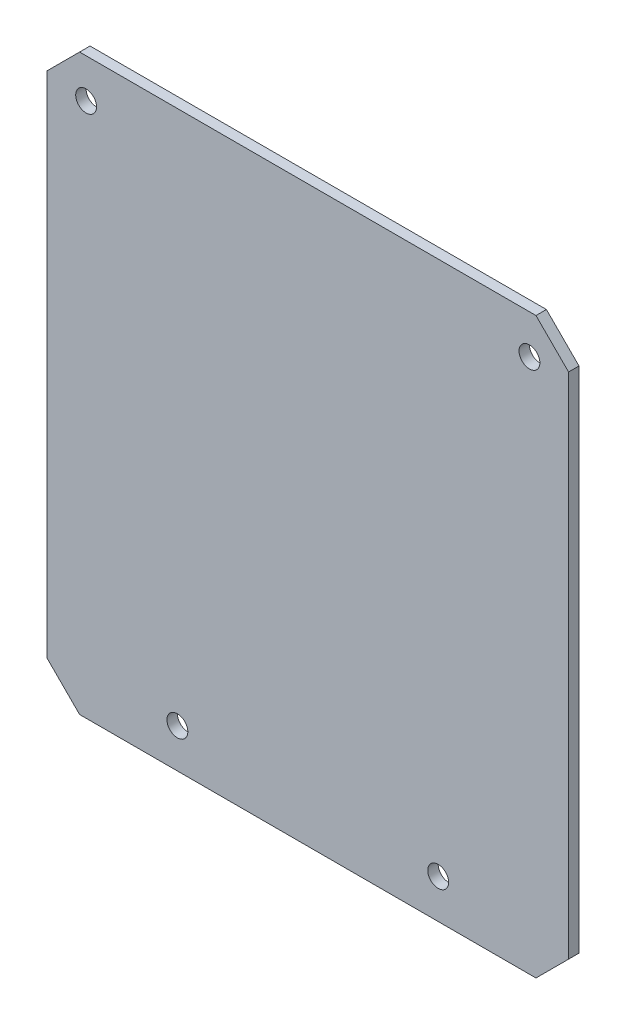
ISO-10303-21;
HEADER;
FILE_DESCRIPTION(('STEP AP214'),'2;1');
FILE_NAME('part.step','',(''),(''),'','','');
FILE_SCHEMA(('AUTOMOTIVE_DESIGN { 1 0 10303 214 1 1 1 1 }'));
ENDSEC;
DATA;
#1=APPLICATION_CONTEXT('core data for automotive mechanical design processes');
#2=APPLICATION_PROTOCOL_DEFINITION('international standard','automotive_design',2000,#1);
#3=PRODUCT_CONTEXT('',#1,'mechanical');
#4=PRODUCT('Part','Part','',(#3));
#5=PRODUCT_RELATED_PRODUCT_CATEGORY('part','',(#4));
#6=PRODUCT_DEFINITION_FORMATION('','',#4);
#7=PRODUCT_DEFINITION_CONTEXT('part definition',#1,'design');
#8=PRODUCT_DEFINITION('design','',#6,#7);
#9=PRODUCT_DEFINITION_SHAPE('','',#8);
#10=(LENGTH_UNIT() NAMED_UNIT(*) SI_UNIT(.MILLI.,.METRE.));
#11=(NAMED_UNIT(*) PLANE_ANGLE_UNIT() SI_UNIT($,.RADIAN.));
#12=(NAMED_UNIT(*) SI_UNIT($,.STERADIAN.) SOLID_ANGLE_UNIT());
#13=UNCERTAINTY_MEASURE_WITH_UNIT(LENGTH_MEASURE(1.E-05),#10,'distance_accuracy_value','');
#14=(GEOMETRIC_REPRESENTATION_CONTEXT(3) GLOBAL_UNCERTAINTY_ASSIGNED_CONTEXT((#13)) GLOBAL_UNIT_ASSIGNED_CONTEXT((#10,
#11,#12)) REPRESENTATION_CONTEXT('',''));
#15=CARTESIAN_POINT('',(0.,0.,0.));
#16=DIRECTION('',(0.,0.,1.));
#17=DIRECTION('',(1.,0.,0.));
#18=AXIS2_PLACEMENT_3D('',#15,#16,#17);
#19=CARTESIAN_POINT('',(0.,0.,1.6));
#20=DIRECTION('',(0.,0.,1.));
#21=DIRECTION('',(1.,0.,0.));
#22=AXIS2_PLACEMENT_3D('',#19,#20,#21);
#23=PLANE('',#22);
#24=CARTESIAN_POINT('',(-18.5,-43.5,1.6));
#25=DIRECTION('',(0.,0.,1.));
#26=DIRECTION('',(1.,0.,0.));
#27=AXIS2_PLACEMENT_3D('',#24,#25,#26);
#28=CIRCLE('',#27,1.6);
#29=CARTESIAN_POINT('',(-16.9,-43.5,1.6));
#30=VERTEX_POINT('',#29);
#31=EDGE_CURVE('E198',#30,#30,#28,.T.);
#32=ORIENTED_EDGE('',*,*,#31,.F.);
#33=EDGE_LOOP('',(#32));
#34=FACE_BOUND('',#33,.T.);
#35=CARTESIAN_POINT('',(-32.5,32.5,1.6));
#36=DIRECTION('',(0.,0.,1.));
#37=DIRECTION('',(1.,0.,0.));
#38=AXIS2_PLACEMENT_3D('',#35,#36,#37);
#39=CIRCLE('',#38,1.6);
#40=CARTESIAN_POINT('',(-30.9,32.5,1.6));
#41=VERTEX_POINT('',#40);
#42=EDGE_CURVE('E144',#41,#41,#39,.T.);
#43=ORIENTED_EDGE('',*,*,#42,.F.);
#44=EDGE_LOOP('',(#43));
#45=FACE_BOUND('',#44,.T.);
#46=DIRECTION('',(0.707106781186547,-0.707106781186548,0.));
#47=VECTOR('',#46,1.);
#48=CARTESIAN_POINT('',(-38.5,-44.5,1.6));
#49=LINE('',#48,#47);
#50=CARTESIAN_POINT('',(-38.5,-44.5,1.6));
#51=VERTEX_POINT('',#50);
#52=CARTESIAN_POINT('',(-33.5,-49.5,1.6));
#53=VERTEX_POINT('',#52);
#54=EDGE_CURVE('E155',#51,#53,#49,.T.);
#55=ORIENTED_EDGE('',*,*,#54,.T.);
#56=DIRECTION('',(1.,0.,0.));
#57=VECTOR('',#56,1.);
#58=CARTESIAN_POINT('',(-33.5,-49.5,1.6));
#59=LINE('',#58,#57);
#60=CARTESIAN_POINT('',(36.5,-49.5,1.6));
#61=VERTEX_POINT('',#60);
#62=EDGE_CURVE('E103',#53,#61,#59,.T.);
#63=ORIENTED_EDGE('',*,*,#62,.T.);
#64=DIRECTION('',(0.707106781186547,0.707106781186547,0.));
#65=VECTOR('',#64,1.);
#66=CARTESIAN_POINT('',(36.5,-49.5,1.6));
#67=LINE('',#66,#65);
#68=CARTESIAN_POINT('',(41.5,-44.5,1.6));
#69=VERTEX_POINT('',#68);
#70=EDGE_CURVE('E170',#61,#69,#67,.T.);
#71=ORIENTED_EDGE('',*,*,#70,.T.);
#72=DIRECTION('',(0.,1.,0.));
#73=VECTOR('',#72,1.);
#74=CARTESIAN_POINT('',(41.5,-44.5,1.6));
#75=LINE('',#74,#73);
#76=CARTESIAN_POINT('',(41.5,33.5,1.6));
#77=VERTEX_POINT('',#76);
#78=EDGE_CURVE('E183',#69,#77,#75,.T.);
#79=ORIENTED_EDGE('',*,*,#78,.T.);
#80=DIRECTION('',(-0.707106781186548,0.707106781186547,0.));
#81=VECTOR('',#80,1.);
#82=CARTESIAN_POINT('',(41.5,33.5,1.6));
#83=LINE('',#82,#81);
#84=CARTESIAN_POINT('',(36.5,38.5,1.6));
#85=VERTEX_POINT('',#84);
#86=EDGE_CURVE('E122',#77,#85,#83,.T.);
#87=ORIENTED_EDGE('',*,*,#86,.T.);
#88=DIRECTION('',(-1.,0.,0.));
#89=VECTOR('',#88,1.);
#90=CARTESIAN_POINT('',(36.5,38.5,1.6));
#91=LINE('',#90,#89);
#92=CARTESIAN_POINT('',(-33.5,38.5,1.6));
#93=VERTEX_POINT('',#92);
#94=EDGE_CURVE('E116',#85,#93,#91,.T.);
#95=ORIENTED_EDGE('',*,*,#94,.T.);
#96=DIRECTION('',(-0.707106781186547,-0.707106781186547,0.));
#97=VECTOR('',#96,1.);
#98=CARTESIAN_POINT('',(-33.5,38.5,1.6));
#99=LINE('',#98,#97);
#100=CARTESIAN_POINT('',(-38.5,33.5,1.6));
#101=VERTEX_POINT('',#100);
#102=EDGE_CURVE('E120',#93,#101,#99,.T.);
#103=ORIENTED_EDGE('',*,*,#102,.T.);
#104=DIRECTION('',(0.,-1.,0.));
#105=VECTOR('',#104,1.);
#106=CARTESIAN_POINT('',(-38.5,33.5,1.6));
#107=LINE('',#106,#105);
#108=EDGE_CURVE('E60',#101,#51,#107,.T.);
#109=ORIENTED_EDGE('',*,*,#108,.T.);
#110=EDGE_LOOP('',(#55,#63,#71,#79,#87,#95,#103,#109));
#111=FACE_BOUND('',#110,.T.);
#112=CARTESIAN_POINT('',(35.5,32.5,1.6));
#113=DIRECTION('',(0.,0.,1.));
#114=DIRECTION('',(1.,0.,0.));
#115=AXIS2_PLACEMENT_3D('',#112,#113,#114);
#116=CIRCLE('',#115,1.6);
#117=CARTESIAN_POINT('',(37.1,32.5,1.6));
#118=VERTEX_POINT('',#117);
#119=EDGE_CURVE('E192',#118,#118,#116,.T.);
#120=ORIENTED_EDGE('',*,*,#119,.F.);
#121=EDGE_LOOP('',(#120));
#122=FACE_BOUND('',#121,.T.);
#123=CARTESIAN_POINT('',(21.5,-43.5,1.6));
#124=DIRECTION('',(0.,0.,1.));
#125=DIRECTION('',(1.,0.,0.));
#126=AXIS2_PLACEMENT_3D('',#123,#124,#125);
#127=CIRCLE('',#126,1.6);
#128=CARTESIAN_POINT('',(23.1,-43.5,1.6));
#129=VERTEX_POINT('',#128);
#130=EDGE_CURVE('E204',#129,#129,#127,.T.);
#131=ORIENTED_EDGE('',*,*,#130,.F.);
#132=EDGE_LOOP('',(#131));
#133=FACE_BOUND('',#132,.T.);
#134=ADVANCED_FACE('F43',(#34,#45,#111,#122,#133),#23,.T.);
#135=CARTESIAN_POINT('',(0.,0.,0.));
#136=DIRECTION('',(0.,0.,1.));
#137=DIRECTION('',(1.,0.,0.));
#138=AXIS2_PLACEMENT_3D('',#135,#136,#137);
#139=PLANE('',#138);
#140=DIRECTION('',(0.707106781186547,-0.707106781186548,0.));
#141=VECTOR('',#140,1.);
#142=CARTESIAN_POINT('',(-38.5,-44.5,0.));
#143=LINE('',#142,#141);
#144=CARTESIAN_POINT('',(-38.5,-44.5,0.));
#145=VERTEX_POINT('',#144);
#146=CARTESIAN_POINT('',(-33.5,-49.5,0.));
#147=VERTEX_POINT('',#146);
#148=EDGE_CURVE('E140',#145,#147,#143,.T.);
#149=ORIENTED_EDGE('',*,*,#148,.F.);
#150=DIRECTION('',(0.,-1.,0.));
#151=VECTOR('',#150,1.);
#152=CARTESIAN_POINT('',(-38.5,33.5,0.));
#153=LINE('',#152,#151);
#154=CARTESIAN_POINT('',(-38.5,33.5,0.));
#155=VERTEX_POINT('',#154);
#156=EDGE_CURVE('E95',#155,#145,#153,.T.);
#157=ORIENTED_EDGE('',*,*,#156,.F.);
#158=DIRECTION('',(-0.707106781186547,-0.707106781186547,0.));
#159=VECTOR('',#158,1.);
#160=CARTESIAN_POINT('',(-33.5,38.5,0.));
#161=LINE('',#160,#159);
#162=CARTESIAN_POINT('',(-33.5,38.5,0.));
#163=VERTEX_POINT('',#162);
#164=EDGE_CURVE('E89',#163,#155,#161,.T.);
#165=ORIENTED_EDGE('',*,*,#164,.F.);
#166=DIRECTION('',(-1.,0.,0.));
#167=VECTOR('',#166,1.);
#168=CARTESIAN_POINT('',(36.5,38.5,0.));
#169=LINE('',#168,#167);
#170=CARTESIAN_POINT('',(36.5,38.5,0.));
#171=VERTEX_POINT('',#170);
#172=EDGE_CURVE('E130',#171,#163,#169,.T.);
#173=ORIENTED_EDGE('',*,*,#172,.F.);
#174=DIRECTION('',(-0.707106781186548,0.707106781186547,0.));
#175=VECTOR('',#174,1.);
#176=CARTESIAN_POINT('',(41.5,33.5,0.));
#177=LINE('',#176,#175);
#178=CARTESIAN_POINT('',(41.5,33.5,0.));
#179=VERTEX_POINT('',#178);
#180=EDGE_CURVE('E150',#179,#171,#177,.T.);
#181=ORIENTED_EDGE('',*,*,#180,.F.);
#182=DIRECTION('',(0.,1.,0.));
#183=VECTOR('',#182,1.);
#184=CARTESIAN_POINT('',(41.5,-44.5,0.));
#185=LINE('',#184,#183);
#186=CARTESIAN_POINT('',(41.5,-44.5,0.));
#187=VERTEX_POINT('',#186);
#188=EDGE_CURVE('E148',#187,#179,#185,.T.);
#189=ORIENTED_EDGE('',*,*,#188,.F.);
#190=DIRECTION('',(0.707106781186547,0.707106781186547,0.));
#191=VECTOR('',#190,1.);
#192=CARTESIAN_POINT('',(36.5,-49.5,0.));
#193=LINE('',#192,#191);
#194=CARTESIAN_POINT('',(36.5,-49.5,0.));
#195=VERTEX_POINT('',#194);
#196=EDGE_CURVE('E146',#195,#187,#193,.T.);
#197=ORIENTED_EDGE('',*,*,#196,.F.);
#198=DIRECTION('',(1.,0.,0.));
#199=VECTOR('',#198,1.);
#200=CARTESIAN_POINT('',(-33.5,-49.5,0.));
#201=LINE('',#200,#199);
#202=EDGE_CURVE('E143',#147,#195,#201,.T.);
#203=ORIENTED_EDGE('',*,*,#202,.F.);
#204=EDGE_LOOP('',(#149,#157,#165,#173,#181,#189,#197,#203));
#205=FACE_BOUND('',#204,.T.);
#206=CARTESIAN_POINT('',(-32.5,32.5,0.));
#207=DIRECTION('',(0.,0.,1.));
#208=DIRECTION('',(1.,0.,0.));
#209=AXIS2_PLACEMENT_3D('',#206,#207,#208);
#210=CIRCLE('',#209,1.6);
#211=CARTESIAN_POINT('',(-30.9,32.5,0.));
#212=VERTEX_POINT('',#211);
#213=EDGE_CURVE('E189',#212,#212,#210,.T.);
#214=ORIENTED_EDGE('',*,*,#213,.T.);
#215=EDGE_LOOP('',(#214));
#216=FACE_BOUND('',#215,.T.);
#217=CARTESIAN_POINT('',(35.5,32.5,0.));
#218=DIRECTION('',(0.,0.,1.));
#219=DIRECTION('',(1.,0.,0.));
#220=AXIS2_PLACEMENT_3D('',#217,#218,#219);
#221=CIRCLE('',#220,1.6);
#222=CARTESIAN_POINT('',(37.1,32.5,0.));
#223=VERTEX_POINT('',#222);
#224=EDGE_CURVE('E195',#223,#223,#221,.T.);
#225=ORIENTED_EDGE('',*,*,#224,.T.);
#226=EDGE_LOOP('',(#225));
#227=FACE_BOUND('',#226,.T.);
#228=CARTESIAN_POINT('',(-18.5,-43.5,0.));
#229=DIRECTION('',(0.,0.,1.));
#230=DIRECTION('',(1.,0.,0.));
#231=AXIS2_PLACEMENT_3D('',#228,#229,#230);
#232=CIRCLE('',#231,1.6);
#233=CARTESIAN_POINT('',(-16.9,-43.5,0.));
#234=VERTEX_POINT('',#233);
#235=EDGE_CURVE('E201',#234,#234,#232,.T.);
#236=ORIENTED_EDGE('',*,*,#235,.T.);
#237=EDGE_LOOP('',(#236));
#238=FACE_BOUND('',#237,.T.);
#239=CARTESIAN_POINT('',(21.5,-43.5,0.));
#240=DIRECTION('',(0.,0.,1.));
#241=DIRECTION('',(1.,0.,0.));
#242=AXIS2_PLACEMENT_3D('',#239,#240,#241);
#243=CIRCLE('',#242,1.6);
#244=CARTESIAN_POINT('',(23.1,-43.5,0.));
#245=VERTEX_POINT('',#244);
#246=EDGE_CURVE('E207',#245,#245,#243,.T.);
#247=ORIENTED_EDGE('',*,*,#246,.T.);
#248=EDGE_LOOP('',(#247));
#249=FACE_BOUND('',#248,.T.);
#250=ADVANCED_FACE('F174',(#205,#216,#227,#238,#249),#139,.F.);
#251=CARTESIAN_POINT('',(-38.5,-44.5,1.6));
#252=DIRECTION('',(0.707106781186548,0.707106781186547,0.));
#253=DIRECTION('',(-0.707106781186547,0.707106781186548,0.));
#254=AXIS2_PLACEMENT_3D('',#251,#252,#253);
#255=PLANE('',#254);
#256=ORIENTED_EDGE('',*,*,#148,.T.);
#257=DIRECTION('',(0.,0.,-1.));
#258=VECTOR('',#257,1.);
#259=CARTESIAN_POINT('',(-33.5,-49.5,1.6));
#260=LINE('',#259,#258);
#261=EDGE_CURVE('E11',#53,#147,#260,.T.);
#262=ORIENTED_EDGE('',*,*,#261,.F.);
#263=ORIENTED_EDGE('',*,*,#54,.F.);
#264=DIRECTION('',(0.,0.,-1.));
#265=VECTOR('',#264,1.);
#266=CARTESIAN_POINT('',(-38.5,-44.5,1.6));
#267=LINE('',#266,#265);
#268=EDGE_CURVE('E136',#51,#145,#267,.T.);
#269=ORIENTED_EDGE('',*,*,#268,.T.);
#270=EDGE_LOOP('',(#256,#262,#263,#269));
#271=FACE_BOUND('',#270,.T.);
#272=ADVANCED_FACE('F45',(#271),#255,.F.);
#273=CARTESIAN_POINT('',(-33.5,-49.5,1.6));
#274=DIRECTION('',(0.,1.,0.));
#275=DIRECTION('',(0.,0.,1.));
#276=AXIS2_PLACEMENT_3D('',#273,#274,#275);
#277=PLANE('',#276);
#278=ORIENTED_EDGE('',*,*,#202,.T.);
#279=DIRECTION('',(0.,0.,-1.));
#280=VECTOR('',#279,1.);
#281=CARTESIAN_POINT('',(36.5,-49.5,1.6));
#282=LINE('',#281,#280);
#283=EDGE_CURVE('E52',#61,#195,#282,.T.);
#284=ORIENTED_EDGE('',*,*,#283,.F.);
#285=ORIENTED_EDGE('',*,*,#62,.F.);
#286=ORIENTED_EDGE('',*,*,#261,.T.);
#287=EDGE_LOOP('',(#278,#284,#285,#286));
#288=FACE_BOUND('',#287,.T.);
#289=ADVANCED_FACE('F241',(#288),#277,.F.);
#290=CARTESIAN_POINT('',(36.5,-49.5,1.6));
#291=DIRECTION('',(-0.707106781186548,0.707106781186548,0.));
#292=DIRECTION('',(-0.707106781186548,-0.707106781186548,0.));
#293=AXIS2_PLACEMENT_3D('',#290,#291,#292);
#294=PLANE('',#293);
#295=ORIENTED_EDGE('',*,*,#196,.T.);
#296=DIRECTION('',(0.,0.,-1.));
#297=VECTOR('',#296,1.);
#298=CARTESIAN_POINT('',(41.5,-44.5,1.6));
#299=LINE('',#298,#297);
#300=EDGE_CURVE('E162',#69,#187,#299,.T.);
#301=ORIENTED_EDGE('',*,*,#300,.F.);
#302=ORIENTED_EDGE('',*,*,#70,.F.);
#303=ORIENTED_EDGE('',*,*,#283,.T.);
#304=EDGE_LOOP('',(#295,#301,#302,#303));
#305=FACE_BOUND('',#304,.T.);
#306=ADVANCED_FACE('F168',(#305),#294,.F.);
#307=CARTESIAN_POINT('',(41.5,-44.5,1.6));
#308=DIRECTION('',(-1.,0.,0.));
#309=DIRECTION('',(0.,0.,1.));
#310=AXIS2_PLACEMENT_3D('',#307,#308,#309);
#311=PLANE('',#310);
#312=ORIENTED_EDGE('',*,*,#188,.T.);
#313=DIRECTION('',(0.,0.,-1.));
#314=VECTOR('',#313,1.);
#315=CARTESIAN_POINT('',(41.5,33.5,1.6));
#316=LINE('',#315,#314);
#317=EDGE_CURVE('E159',#77,#179,#316,.T.);
#318=ORIENTED_EDGE('',*,*,#317,.F.);
#319=ORIENTED_EDGE('',*,*,#78,.F.);
#320=ORIENTED_EDGE('',*,*,#300,.T.);
#321=EDGE_LOOP('',(#312,#318,#319,#320));
#322=FACE_BOUND('',#321,.T.);
#323=ADVANCED_FACE('F179',(#322),#311,.F.);
#324=CARTESIAN_POINT('',(41.5,33.5,1.6));
#325=DIRECTION('',(-0.707106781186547,-0.707106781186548,0.));
#326=DIRECTION('',(0.707106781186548,-0.707106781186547,0.));
#327=AXIS2_PLACEMENT_3D('',#324,#325,#326);
#328=PLANE('',#327);
#329=ORIENTED_EDGE('',*,*,#180,.T.);
#330=DIRECTION('',(0.,0.,-1.));
#331=VECTOR('',#330,1.);
#332=CARTESIAN_POINT('',(36.5,38.5,1.6));
#333=LINE('',#332,#331);
#334=EDGE_CURVE('E131',#85,#171,#333,.T.);
#335=ORIENTED_EDGE('',*,*,#334,.F.);
#336=ORIENTED_EDGE('',*,*,#86,.F.);
#337=ORIENTED_EDGE('',*,*,#317,.T.);
#338=EDGE_LOOP('',(#329,#335,#336,#337));
#339=FACE_BOUND('',#338,.T.);
#340=ADVANCED_FACE('F182',(#339),#328,.F.);
#341=CARTESIAN_POINT('',(36.5,38.5,1.6));
#342=DIRECTION('',(0.,-1.,0.));
#343=DIRECTION('',(0.,0.,-1.));
#344=AXIS2_PLACEMENT_3D('',#341,#342,#343);
#345=PLANE('',#344);
#346=ORIENTED_EDGE('',*,*,#172,.T.);
#347=DIRECTION('',(0.,0.,-1.));
#348=VECTOR('',#347,1.);
#349=CARTESIAN_POINT('',(-33.5,38.5,1.6));
#350=LINE('',#349,#348);
#351=EDGE_CURVE('E127',#93,#163,#350,.T.);
#352=ORIENTED_EDGE('',*,*,#351,.F.);
#353=ORIENTED_EDGE('',*,*,#94,.F.);
#354=ORIENTED_EDGE('',*,*,#334,.T.);
#355=EDGE_LOOP('',(#346,#352,#353,#354));
#356=FACE_BOUND('',#355,.T.);
#357=ADVANCED_FACE('F128',(#356),#345,.F.);
#358=CARTESIAN_POINT('',(-33.5,38.5,1.6));
#359=DIRECTION('',(0.707106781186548,-0.707106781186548,0.));
#360=DIRECTION('',(0.707106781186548,0.707106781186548,0.));
#361=AXIS2_PLACEMENT_3D('',#358,#359,#360);
#362=PLANE('',#361);
#363=ORIENTED_EDGE('',*,*,#164,.T.);
#364=DIRECTION('',(0.,0.,-1.));
#365=VECTOR('',#364,1.);
#366=CARTESIAN_POINT('',(-38.5,33.5,1.6));
#367=LINE('',#366,#365);
#368=EDGE_CURVE('E132',#101,#155,#367,.T.);
#369=ORIENTED_EDGE('',*,*,#368,.F.);
#370=ORIENTED_EDGE('',*,*,#102,.F.);
#371=ORIENTED_EDGE('',*,*,#351,.T.);
#372=EDGE_LOOP('',(#363,#369,#370,#371));
#373=FACE_BOUND('',#372,.T.);
#374=ADVANCED_FACE('F134',(#373),#362,.F.);
#375=CARTESIAN_POINT('',(-38.5,33.5,1.6));
#376=DIRECTION('',(1.,0.,0.));
#377=DIRECTION('',(0.,0.,-1.));
#378=AXIS2_PLACEMENT_3D('',#375,#376,#377);
#379=PLANE('',#378);
#380=ORIENTED_EDGE('',*,*,#156,.T.);
#381=ORIENTED_EDGE('',*,*,#268,.F.);
#382=ORIENTED_EDGE('',*,*,#108,.F.);
#383=ORIENTED_EDGE('',*,*,#368,.T.);
#384=EDGE_LOOP('',(#380,#381,#382,#383));
#385=FACE_BOUND('',#384,.T.);
#386=ADVANCED_FACE('F229',(#385),#379,.F.);
#387=CARTESIAN_POINT('',(-32.5,32.5,1.6));
#388=DIRECTION('',(0.,0.,-1.));
#389=DIRECTION('',(-1.,0.,0.));
#390=AXIS2_PLACEMENT_3D('',#387,#388,#389);
#391=CYLINDRICAL_SURFACE('',#390,1.6);
#392=ORIENTED_EDGE('',*,*,#42,.T.);
#393=EDGE_LOOP('',(#392));
#394=FACE_BOUND('',#393,.T.);
#395=ORIENTED_EDGE('',*,*,#213,.F.);
#396=EDGE_LOOP('',(#395));
#397=FACE_BOUND('',#396,.T.);
#398=ADVANCED_FACE('F226',(#394,#397),#391,.F.);
#399=CARTESIAN_POINT('',(35.5,32.5,1.6));
#400=DIRECTION('',(0.,0.,-1.));
#401=DIRECTION('',(-1.,0.,0.));
#402=AXIS2_PLACEMENT_3D('',#399,#400,#401);
#403=CYLINDRICAL_SURFACE('',#402,1.6);
#404=ORIENTED_EDGE('',*,*,#119,.T.);
#405=EDGE_LOOP('',(#404));
#406=FACE_BOUND('',#405,.T.);
#407=ORIENTED_EDGE('',*,*,#224,.F.);
#408=EDGE_LOOP('',(#407));
#409=FACE_BOUND('',#408,.T.);
#410=ADVANCED_FACE('F304',(#406,#409),#403,.F.);
#411=CARTESIAN_POINT('',(-18.5,-43.5,1.6));
#412=DIRECTION('',(0.,0.,-1.));
#413=DIRECTION('',(-1.,0.,0.));
#414=AXIS2_PLACEMENT_3D('',#411,#412,#413);
#415=CYLINDRICAL_SURFACE('',#414,1.6);
#416=ORIENTED_EDGE('',*,*,#31,.T.);
#417=EDGE_LOOP('',(#416));
#418=FACE_BOUND('',#417,.T.);
#419=ORIENTED_EDGE('',*,*,#235,.F.);
#420=EDGE_LOOP('',(#419));
#421=FACE_BOUND('',#420,.T.);
#422=ADVANCED_FACE('F312',(#418,#421),#415,.F.);
#423=CARTESIAN_POINT('',(21.5,-43.5,1.6));
#424=DIRECTION('',(0.,0.,-1.));
#425=DIRECTION('',(-1.,0.,0.));
#426=AXIS2_PLACEMENT_3D('',#423,#424,#425);
#427=CYLINDRICAL_SURFACE('',#426,1.6);
#428=ORIENTED_EDGE('',*,*,#130,.T.);
#429=EDGE_LOOP('',(#428));
#430=FACE_BOUND('',#429,.T.);
#431=ORIENTED_EDGE('',*,*,#246,.F.);
#432=EDGE_LOOP('',(#431));
#433=FACE_BOUND('',#432,.T.);
#434=ADVANCED_FACE('F213',(#430,#433),#427,.F.);
#435=CLOSED_SHELL('',(#134,#250,#272,#289,#306,#323,#340,#357,#374,#386,#398,#410,#422,#434));
#436=MANIFOLD_SOLID_BREP('B2',#435);
#437=ADVANCED_BREP_SHAPE_REPRESENTATION('',(#18,#436),#14);
#438=SHAPE_DEFINITION_REPRESENTATION(#9,#437);
ENDSEC;
END-ISO-10303-21;
